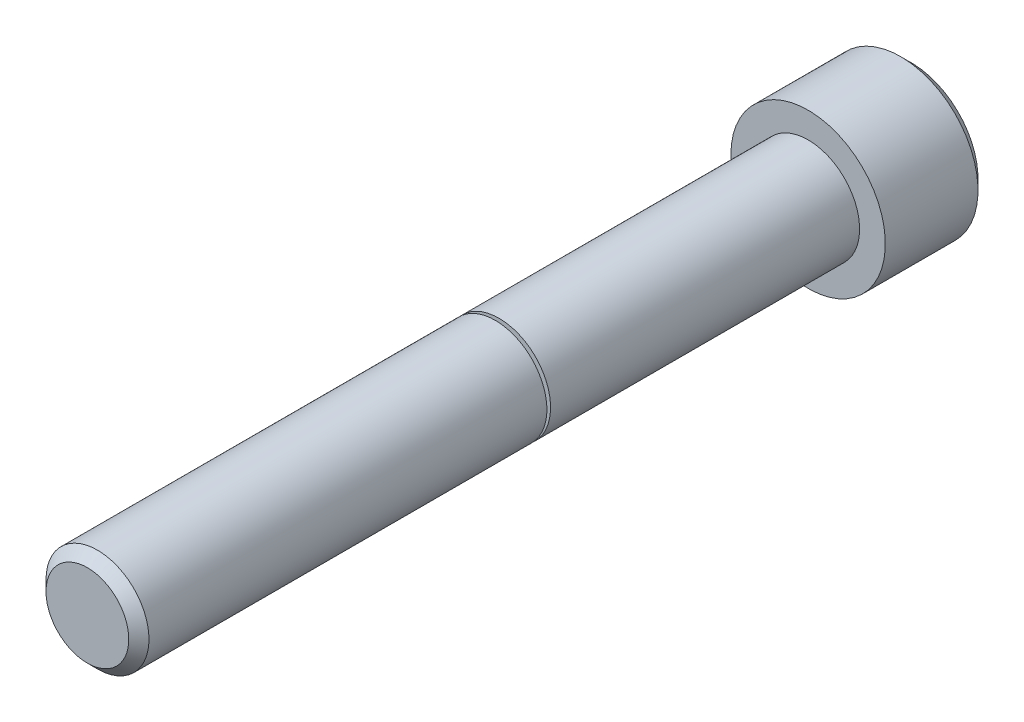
ISO-10303-21;
HEADER;
FILE_DESCRIPTION(('STEP AP214'),'2;1');
FILE_NAME('part.step','',(''),(''),'','','');
FILE_SCHEMA(('AUTOMOTIVE_DESIGN { 1 0 10303 214 1 1 1 1 }'));
ENDSEC;
DATA;
#1=APPLICATION_CONTEXT('core data for automotive mechanical design processes');
#2=APPLICATION_PROTOCOL_DEFINITION('international standard','automotive_design',2000,#1);
#3=PRODUCT_CONTEXT('',#1,'mechanical');
#4=PRODUCT('Part','Part','',(#3));
#5=PRODUCT_RELATED_PRODUCT_CATEGORY('part','',(#4));
#6=PRODUCT_DEFINITION_FORMATION('','',#4);
#7=PRODUCT_DEFINITION_CONTEXT('part definition',#1,'design');
#8=PRODUCT_DEFINITION('design','',#6,#7);
#9=PRODUCT_DEFINITION_SHAPE('','',#8);
#10=(LENGTH_UNIT() NAMED_UNIT(*) SI_UNIT(.MILLI.,.METRE.));
#11=(NAMED_UNIT(*) PLANE_ANGLE_UNIT() SI_UNIT($,.RADIAN.));
#12=(NAMED_UNIT(*) SI_UNIT($,.STERADIAN.) SOLID_ANGLE_UNIT());
#13=UNCERTAINTY_MEASURE_WITH_UNIT(LENGTH_MEASURE(1.E-05),#10,'distance_accuracy_value','');
#14=(GEOMETRIC_REPRESENTATION_CONTEXT(3) GLOBAL_UNCERTAINTY_ASSIGNED_CONTEXT((#13)) GLOBAL_UNIT_ASSIGNED_CONTEXT((#10,
#11,#12)) REPRESENTATION_CONTEXT('',''));
#15=CARTESIAN_POINT('',(0.,0.,0.));
#16=DIRECTION('',(0.,0.,1.));
#17=DIRECTION('',(1.,0.,0.));
#18=AXIS2_PLACEMENT_3D('',#15,#16,#17);
#19=CARTESIAN_POINT('',(0.,0.,-6.34999999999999));
#20=DIRECTION('',(0.,0.,1.));
#21=DIRECTION('',(1.,0.,0.));
#22=AXIS2_PLACEMENT_3D('',#19,#20,#21);
#23=PLANE('',#22);
#24=DIRECTION('',(-0.5,-0.866025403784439,0.));
#25=VECTOR('',#24,1.);
#26=CARTESIAN_POINT('',(2.74963065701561,0.,-6.34999999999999));
#27=LINE('',#26,#25);
#28=CARTESIAN_POINT('',(2.74963065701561,0.,-6.34999999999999));
#29=VERTEX_POINT('',#28);
#30=CARTESIAN_POINT('',(1.37481532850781,-2.38125,-6.34999999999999));
#31=VERTEX_POINT('',#30);
#32=EDGE_CURVE('E145',#29,#31,#27,.T.);
#33=ORIENTED_EDGE('',*,*,#32,.F.);
#34=DIRECTION('',(0.499999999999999,-0.866025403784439,0.));
#35=VECTOR('',#34,1.);
#36=CARTESIAN_POINT('',(1.37481532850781,2.38125,-6.34999999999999));
#37=LINE('',#36,#35);
#38=CARTESIAN_POINT('',(1.37481532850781,2.38125,-6.34999999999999));
#39=VERTEX_POINT('',#38);
#40=EDGE_CURVE('E64',#39,#29,#37,.T.);
#41=ORIENTED_EDGE('',*,*,#40,.F.);
#42=DIRECTION('',(1.,0.,0.));
#43=VECTOR('',#42,1.);
#44=CARTESIAN_POINT('',(-1.37481532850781,2.38125,-6.34999999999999));
#45=LINE('',#44,#43);
#46=CARTESIAN_POINT('',(-1.37481532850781,2.38125,-6.34999999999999));
#47=VERTEX_POINT('',#46);
#48=EDGE_CURVE('E158',#47,#39,#45,.T.);
#49=ORIENTED_EDGE('',*,*,#48,.F.);
#50=DIRECTION('',(0.5,0.866025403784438,0.));
#51=VECTOR('',#50,1.);
#52=CARTESIAN_POINT('',(-2.74963065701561,0.,-6.34999999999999));
#53=LINE('',#52,#51);
#54=CARTESIAN_POINT('',(-2.74963065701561,0.,-6.34999999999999));
#55=VERTEX_POINT('',#54);
#56=EDGE_CURVE('E155',#55,#47,#53,.T.);
#57=ORIENTED_EDGE('',*,*,#56,.F.);
#58=DIRECTION('',(-0.5,0.866025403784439,0.));
#59=VECTOR('',#58,1.);
#60=CARTESIAN_POINT('',(-1.37481532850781,-2.38125,-6.34999999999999));
#61=LINE('',#60,#59);
#62=CARTESIAN_POINT('',(-1.37481532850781,-2.38125,-6.34999999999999));
#63=VERTEX_POINT('',#62);
#64=EDGE_CURVE('E112',#63,#55,#61,.T.);
#65=ORIENTED_EDGE('',*,*,#64,.F.);
#66=DIRECTION('',(-1.,0.,0.));
#67=VECTOR('',#66,1.);
#68=CARTESIAN_POINT('',(1.37481532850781,-2.38125,-6.34999999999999));
#69=LINE('',#68,#67);
#70=EDGE_CURVE('E149',#31,#63,#69,.T.);
#71=ORIENTED_EDGE('',*,*,#70,.F.);
#72=EDGE_LOOP('',(#33,#41,#49,#57,#65,#71));
#73=FACE_BOUND('',#72,.T.);
#74=CARTESIAN_POINT('',(0.,0.,-6.34999999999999));
#75=DIRECTION('',(0.,0.,-1.));
#76=DIRECTION('',(-1.,0.,0.));
#77=AXIS2_PLACEMENT_3D('',#74,#75,#76);
#78=CIRCLE('',#77,4.1275);
#79=CARTESIAN_POINT('',(-4.1275,0.,-6.34999999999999));
#80=VERTEX_POINT('',#79);
#81=EDGE_CURVE('E164',#80,#80,#78,.T.);
#82=ORIENTED_EDGE('',*,*,#81,.T.);
#83=EDGE_LOOP('',(#82));
#84=FACE_BOUND('',#83,.T.);
#85=ADVANCED_FACE('F49',(#73,#84),#23,.F.);
#86=CARTESIAN_POINT('',(-2.55270000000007,0.,44.45));
#87=DIRECTION('',(0.,0.,-1.));
#88=DIRECTION('',(-1.,0.,0.));
#89=AXIS2_PLACEMENT_3D('',#86,#87,#88);
#90=PLANE('',#89);
#91=CARTESIAN_POINT('',(0.,0.,44.45));
#92=DIRECTION('',(0.,0.,-1.));
#93=DIRECTION('',(-1.,0.,0.));
#94=AXIS2_PLACEMENT_3D('',#91,#92,#93);
#95=CIRCLE('',#94,2.55270000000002);
#96=CARTESIAN_POINT('',(-2.55270000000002,0.,44.45));
#97=VERTEX_POINT('',#96);
#98=EDGE_CURVE('E11',#97,#97,#95,.T.);
#99=ORIENTED_EDGE('',*,*,#98,.F.);
#100=EDGE_LOOP('',(#99));
#101=FACE_BOUND('',#100,.T.);
#102=ADVANCED_FACE('F214',(#101),#90,.F.);
#103=CARTESIAN_POINT('',(0.,0.,44.45));
#104=DIRECTION('',(0.,0.,-1.));
#105=DIRECTION('',(-1.,0.,0.));
#106=AXIS2_PLACEMENT_3D('',#103,#104,#105);
#107=CONICAL_SURFACE('',#106,2.55270000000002,0.785398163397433);
#108=CARTESIAN_POINT('',(0.,0.,43.8277));
#109=DIRECTION('',(0.,0.,-1.));
#110=DIRECTION('',(-1.,0.,0.));
#111=AXIS2_PLACEMENT_3D('',#108,#109,#110);
#112=CIRCLE('',#111,3.17500000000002);
#113=CARTESIAN_POINT('',(-3.17500000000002,0.,43.8277));
#114=VERTEX_POINT('',#113);
#115=EDGE_CURVE('E57',#114,#114,#112,.T.);
#116=ORIENTED_EDGE('',*,*,#115,.F.);
#117=EDGE_LOOP('',(#116));
#118=FACE_BOUND('',#117,.T.);
#119=ORIENTED_EDGE('',*,*,#98,.T.);
#120=EDGE_LOOP('',(#119));
#121=FACE_BOUND('',#120,.T.);
#122=ADVANCED_FACE('F211',(#118,#121),#107,.T.);
#123=CARTESIAN_POINT('',(0.,0.,-10.585154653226));
#124=DIRECTION('',(0.,0.,-1.));
#125=DIRECTION('',(-1.,0.,0.));
#126=AXIS2_PLACEMENT_3D('',#123,#124,#125);
#127=CYLINDRICAL_SURFACE('',#126,3.17500000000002);
#128=CARTESIAN_POINT('',(0.,0.,19.2864986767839));
#129=DIRECTION('',(0.,0.,-1.));
#130=DIRECTION('',(-1.,0.,0.));
#131=AXIS2_PLACEMENT_3D('',#128,#129,#130);
#132=CIRCLE('',#131,3.17500000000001);
#133=CARTESIAN_POINT('',(-3.17500000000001,0.,19.2864986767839));
#134=VERTEX_POINT('',#133);
#135=EDGE_CURVE('E201',#134,#134,#132,.T.);
#136=ORIENTED_EDGE('',*,*,#135,.F.);
#137=EDGE_LOOP('',(#136));
#138=FACE_BOUND('',#137,.T.);
#139=ORIENTED_EDGE('',*,*,#115,.T.);
#140=EDGE_LOOP('',(#139));
#141=FACE_BOUND('',#140,.T.);
#142=ADVANCED_FACE('F209',(#138,#141),#127,.T.);
#143=CARTESIAN_POINT('',(0.,0.,19.2864986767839));
#144=DIRECTION('',(0.,0.,1.));
#145=DIRECTION('',(1.,0.,0.));
#146=AXIS2_PLACEMENT_3D('',#143,#144,#145);
#147=CONICAL_SURFACE('',#146,3.17500000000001,1.22173047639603);
#148=CARTESIAN_POINT('',(0.,0.,19.0987938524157));
#149=DIRECTION('',(0.,0.,-1.));
#150=DIRECTION('',(-1.,0.,0.));
#151=AXIS2_PLACEMENT_3D('',#148,#149,#150);
#152=CIRCLE('',#151,2.65928523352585);
#153=CARTESIAN_POINT('',(-2.65928523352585,0.,19.0987938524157));
#154=VERTEX_POINT('',#153);
#155=EDGE_CURVE('E197',#154,#154,#152,.T.);
#156=ORIENTED_EDGE('',*,*,#155,.F.);
#157=EDGE_LOOP('',(#156));
#158=FACE_BOUND('',#157,.T.);
#159=ORIENTED_EDGE('',*,*,#135,.T.);
#160=EDGE_LOOP('',(#159));
#161=FACE_BOUND('',#160,.T.);
#162=ADVANCED_FACE('F226',(#158,#161),#147,.T.);
#163=CARTESIAN_POINT('',(0.,0.,19.08));
#164=DIRECTION('',(0.,0.,-1.));
#165=DIRECTION('',(-1.,0.,0.));
#166=AXIS2_PLACEMENT_3D('',#163,#164,#165);
#167=TOROIDAL_SURFACE('',#166,2.66612563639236,0.0199999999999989);
#168=CARTESIAN_POINT('',(0.,0.,19.06));
#169=DIRECTION('',(0.,0.,-1.));
#170=DIRECTION('',(-1.,0.,0.));
#171=AXIS2_PLACEMENT_3D('',#168,#169,#170);
#172=CIRCLE('',#171,2.66612563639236);
#173=CARTESIAN_POINT('',(-2.66612563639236,0.,19.06));
#174=VERTEX_POINT('',#173);
#175=EDGE_CURVE('E193',#174,#174,#172,.T.);
#176=ORIENTED_EDGE('',*,*,#175,.F.);
#177=EDGE_LOOP('',(#176));
#178=FACE_BOUND('',#177,.T.);
#179=ORIENTED_EDGE('',*,*,#155,.T.);
#180=EDGE_LOOP('',(#179));
#181=FACE_BOUND('',#180,.T.);
#182=ADVANCED_FACE('F230',(#178,#181),#167,.F.);
#183=CARTESIAN_POINT('',(-3.17500000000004,0.,19.06));
#184=DIRECTION('',(0.,0.,-1.));
#185=DIRECTION('',(-1.,0.,0.));
#186=AXIS2_PLACEMENT_3D('',#183,#184,#185);
#187=PLANE('',#186);
#188=CARTESIAN_POINT('',(0.,0.,19.06));
#189=DIRECTION('',(0.,0.,-1.));
#190=DIRECTION('',(-1.,0.,0.));
#191=AXIS2_PLACEMENT_3D('',#188,#189,#190);
#192=CIRCLE('',#191,3.17500000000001);
#193=CARTESIAN_POINT('',(-3.17500000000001,0.,19.06));
#194=VERTEX_POINT('',#193);
#195=EDGE_CURVE('E189',#194,#194,#192,.T.);
#196=ORIENTED_EDGE('',*,*,#195,.F.);
#197=EDGE_LOOP('',(#196));
#198=FACE_BOUND('',#197,.T.);
#199=ORIENTED_EDGE('',*,*,#175,.T.);
#200=EDGE_LOOP('',(#199));
#201=FACE_BOUND('',#200,.T.);
#202=ADVANCED_FACE('F234',(#198,#201),#187,.F.);
#203=CARTESIAN_POINT('',(0.,0.,-10.585154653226));
#204=DIRECTION('',(0.,0.,-1.));
#205=DIRECTION('',(-1.,0.,0.));
#206=AXIS2_PLACEMENT_3D('',#203,#204,#205);
#207=CYLINDRICAL_SURFACE('',#206,3.17500000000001);
#208=CARTESIAN_POINT('',(0.,0.,0.));
#209=DIRECTION('',(0.,0.,-1.));
#210=DIRECTION('',(-1.,0.,0.));
#211=AXIS2_PLACEMENT_3D('',#208,#209,#210);
#212=CIRCLE('',#211,3.175);
#213=CARTESIAN_POINT('',(-3.175,0.,0.));
#214=VERTEX_POINT('',#213);
#215=EDGE_CURVE('E185',#214,#214,#212,.T.);
#216=ORIENTED_EDGE('',*,*,#215,.F.);
#217=EDGE_LOOP('',(#216));
#218=FACE_BOUND('',#217,.T.);
#219=ORIENTED_EDGE('',*,*,#195,.T.);
#220=EDGE_LOOP('',(#219));
#221=FACE_BOUND('',#220,.T.);
#222=ADVANCED_FACE('F238',(#218,#221),#207,.T.);
#223=CARTESIAN_POINT('',(-4.7625,0.,0.));
#224=DIRECTION('',(0.,0.,-1.));
#225=DIRECTION('',(-1.,0.,0.));
#226=AXIS2_PLACEMENT_3D('',#223,#224,#225);
#227=PLANE('',#226);
#228=CARTESIAN_POINT('',(0.,0.,0.));
#229=DIRECTION('',(0.,0.,-1.));
#230=DIRECTION('',(-1.,0.,0.));
#231=AXIS2_PLACEMENT_3D('',#228,#229,#230);
#232=CIRCLE('',#231,4.7625);
#233=CARTESIAN_POINT('',(-4.7625,0.,0.));
#234=VERTEX_POINT('',#233);
#235=EDGE_CURVE('E181',#234,#234,#232,.T.);
#236=ORIENTED_EDGE('',*,*,#235,.F.);
#237=EDGE_LOOP('',(#236));
#238=FACE_BOUND('',#237,.T.);
#239=ORIENTED_EDGE('',*,*,#215,.T.);
#240=EDGE_LOOP('',(#239));
#241=FACE_BOUND('',#240,.T.);
#242=ADVANCED_FACE('F242',(#238,#241),#227,.F.);
#243=CARTESIAN_POINT('',(0.,0.,-10.585154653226));
#244=DIRECTION('',(0.,0.,-1.));
#245=DIRECTION('',(-1.,0.,0.));
#246=AXIS2_PLACEMENT_3D('',#243,#244,#245);
#247=CYLINDRICAL_SURFACE('',#246,4.7625);
#248=CARTESIAN_POINT('',(0.,0.,-5.715));
#249=DIRECTION('',(0.,0.,-1.));
#250=DIRECTION('',(-1.,0.,0.));
#251=AXIS2_PLACEMENT_3D('',#248,#249,#250);
#252=CIRCLE('',#251,4.7625);
#253=CARTESIAN_POINT('',(-4.7625,0.,-5.715));
#254=VERTEX_POINT('',#253);
#255=EDGE_CURVE('E177',#254,#254,#252,.T.);
#256=ORIENTED_EDGE('',*,*,#255,.F.);
#257=EDGE_LOOP('',(#256));
#258=FACE_BOUND('',#257,.T.);
#259=ORIENTED_EDGE('',*,*,#235,.T.);
#260=EDGE_LOOP('',(#259));
#261=FACE_BOUND('',#260,.T.);
#262=ADVANCED_FACE('F246',(#258,#261),#247,.T.);
#263=CARTESIAN_POINT('',(0.,0.,-5.715));
#264=DIRECTION('',(0.,0.,1.));
#265=DIRECTION('',(1.,0.,0.));
#266=AXIS2_PLACEMENT_3D('',#263,#264,#265);
#267=CONICAL_SURFACE('',#266,4.7625,0.785398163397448);
#268=ORIENTED_EDGE('',*,*,#81,.F.);
#269=EDGE_LOOP('',(#268));
#270=FACE_BOUND('',#269,.T.);
#271=ORIENTED_EDGE('',*,*,#255,.T.);
#272=EDGE_LOOP('',(#271));
#273=FACE_BOUND('',#272,.T.);
#274=ADVANCED_FACE('F250',(#270,#273),#267,.T.);
#275=CARTESIAN_POINT('',(1.37481532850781,2.38125,-3.175));
#276=DIRECTION('',(0.866025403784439,0.499999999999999,0.));
#277=DIRECTION('',(-0.5,0.866025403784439,0.));
#278=AXIS2_PLACEMENT_3D('',#275,#276,#277);
#279=PLANE('',#278);
#280=ORIENTED_EDGE('',*,*,#40,.T.);
#281=DIRECTION('',(0.,0.,-1.));
#282=VECTOR('',#281,1.);
#283=CARTESIAN_POINT('',(2.74963065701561,0.,-3.175));
#284=LINE('',#283,#282);
#285=CARTESIAN_POINT('',(2.74963065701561,0.,-3.175));
#286=VERTEX_POINT('',#285);
#287=EDGE_CURVE('E94',#286,#29,#284,.T.);
#288=ORIENTED_EDGE('',*,*,#287,.F.);
#289=DIRECTION('',(0.499999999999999,-0.866025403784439,0.));
#290=VECTOR('',#289,1.);
#291=CARTESIAN_POINT('',(1.37481532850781,2.38125,-3.175));
#292=LINE('',#291,#290);
#293=CARTESIAN_POINT('',(1.37481532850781,2.38125,-3.175));
#294=VERTEX_POINT('',#293);
#295=EDGE_CURVE('E161',#294,#286,#292,.T.);
#296=ORIENTED_EDGE('',*,*,#295,.F.);
#297=DIRECTION('',(0.,0.,-1.));
#298=VECTOR('',#297,1.);
#299=CARTESIAN_POINT('',(1.37481532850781,2.38125,-3.175));
#300=LINE('',#299,#298);
#301=EDGE_CURVE('E72',#294,#39,#300,.T.);
#302=ORIENTED_EDGE('',*,*,#301,.T.);
#303=EDGE_LOOP('',(#280,#288,#296,#302));
#304=FACE_BOUND('',#303,.T.);
#305=ADVANCED_FACE('F254',(#304),#279,.F.);
#306=CARTESIAN_POINT('',(-1.37481532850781,2.38125,-3.175));
#307=DIRECTION('',(0.,1.,0.));
#308=DIRECTION('',(-1.,0.,0.));
#309=AXIS2_PLACEMENT_3D('',#306,#307,#308);
#310=PLANE('',#309);
#311=ORIENTED_EDGE('',*,*,#48,.T.);
#312=ORIENTED_EDGE('',*,*,#301,.F.);
#313=DIRECTION('',(1.,0.,0.));
#314=VECTOR('',#313,1.);
#315=CARTESIAN_POINT('',(-1.37481532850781,2.38125,-3.175));
#316=LINE('',#315,#314);
#317=CARTESIAN_POINT('',(-1.37481532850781,2.38125,-3.175));
#318=VERTEX_POINT('',#317);
#319=EDGE_CURVE('E126',#318,#294,#316,.T.);
#320=ORIENTED_EDGE('',*,*,#319,.F.);
#321=DIRECTION('',(0.,0.,-1.));
#322=VECTOR('',#321,1.);
#323=CARTESIAN_POINT('',(-1.37481532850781,2.38125,-3.175));
#324=LINE('',#323,#322);
#325=EDGE_CURVE('E117',#318,#47,#324,.T.);
#326=ORIENTED_EDGE('',*,*,#325,.T.);
#327=EDGE_LOOP('',(#311,#312,#320,#326));
#328=FACE_BOUND('',#327,.T.);
#329=ADVANCED_FACE('F258',(#328),#310,.F.);
#330=CARTESIAN_POINT('',(-2.74963065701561,0.,-3.175));
#331=DIRECTION('',(-0.866025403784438,0.5,0.));
#332=DIRECTION('',(-0.5,-0.866025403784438,0.));
#333=AXIS2_PLACEMENT_3D('',#330,#331,#332);
#334=PLANE('',#333);
#335=ORIENTED_EDGE('',*,*,#56,.T.);
#336=ORIENTED_EDGE('',*,*,#325,.F.);
#337=DIRECTION('',(0.5,0.866025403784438,0.));
#338=VECTOR('',#337,1.);
#339=CARTESIAN_POINT('',(-2.74963065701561,0.,-3.175));
#340=LINE('',#339,#338);
#341=CARTESIAN_POINT('',(-2.74963065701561,0.,-3.175));
#342=VERTEX_POINT('',#341);
#343=EDGE_CURVE('E121',#342,#318,#340,.T.);
#344=ORIENTED_EDGE('',*,*,#343,.F.);
#345=DIRECTION('',(0.,0.,-1.));
#346=VECTOR('',#345,1.);
#347=CARTESIAN_POINT('',(-2.74963065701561,0.,-3.175));
#348=LINE('',#347,#346);
#349=EDGE_CURVE('E105',#342,#55,#348,.T.);
#350=ORIENTED_EDGE('',*,*,#349,.T.);
#351=EDGE_LOOP('',(#335,#336,#344,#350));
#352=FACE_BOUND('',#351,.T.);
#353=ADVANCED_FACE('F122',(#352),#334,.F.);
#354=CARTESIAN_POINT('',(-1.37481532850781,-2.38125,-3.175));
#355=DIRECTION('',(-0.866025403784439,-0.5,0.));
#356=DIRECTION('',(0.5,-0.866025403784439,0.));
#357=AXIS2_PLACEMENT_3D('',#354,#355,#356);
#358=PLANE('',#357);
#359=ORIENTED_EDGE('',*,*,#64,.T.);
#360=ORIENTED_EDGE('',*,*,#349,.F.);
#361=DIRECTION('',(-0.5,0.866025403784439,0.));
#362=VECTOR('',#361,1.);
#363=CARTESIAN_POINT('',(-1.37481532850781,-2.38125,-3.175));
#364=LINE('',#363,#362);
#365=CARTESIAN_POINT('',(-1.37481532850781,-2.38125,-3.175));
#366=VERTEX_POINT('',#365);
#367=EDGE_CURVE('E109',#366,#342,#364,.T.);
#368=ORIENTED_EDGE('',*,*,#367,.F.);
#369=DIRECTION('',(0.,0.,-1.));
#370=VECTOR('',#369,1.);
#371=CARTESIAN_POINT('',(-1.37481532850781,-2.38125,-3.175));
#372=LINE('',#371,#370);
#373=EDGE_CURVE('E118',#366,#63,#372,.T.);
#374=ORIENTED_EDGE('',*,*,#373,.T.);
#375=EDGE_LOOP('',(#359,#360,#368,#374));
#376=FACE_BOUND('',#375,.T.);
#377=ADVANCED_FACE('F107',(#376),#358,.F.);
#378=CARTESIAN_POINT('',(1.37481532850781,-2.38125,-3.175));
#379=DIRECTION('',(0.,-1.,0.));
#380=DIRECTION('',(0.,0.,-1.));
#381=AXIS2_PLACEMENT_3D('',#378,#379,#380);
#382=PLANE('',#381);
#383=ORIENTED_EDGE('',*,*,#70,.T.);
#384=ORIENTED_EDGE('',*,*,#373,.F.);
#385=DIRECTION('',(-1.,0.,0.));
#386=VECTOR('',#385,1.);
#387=CARTESIAN_POINT('',(1.37481532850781,-2.38125,-3.175));
#388=LINE('',#387,#386);
#389=CARTESIAN_POINT('',(1.37481532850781,-2.38125,-3.175));
#390=VERTEX_POINT('',#389);
#391=EDGE_CURVE('E132',#390,#366,#388,.T.);
#392=ORIENTED_EDGE('',*,*,#391,.F.);
#393=DIRECTION('',(0.,0.,-1.));
#394=VECTOR('',#393,1.);
#395=CARTESIAN_POINT('',(1.37481532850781,-2.38125,-3.175));
#396=LINE('',#395,#394);
#397=EDGE_CURVE('E169',#390,#31,#396,.T.);
#398=ORIENTED_EDGE('',*,*,#397,.T.);
#399=EDGE_LOOP('',(#383,#384,#392,#398));
#400=FACE_BOUND('',#399,.T.);
#401=ADVANCED_FACE('F262',(#400),#382,.F.);
#402=CARTESIAN_POINT('',(2.74963065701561,0.,-3.175));
#403=DIRECTION('',(0.866025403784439,-0.5,0.));
#404=DIRECTION('',(0.5,0.866025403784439,0.));
#405=AXIS2_PLACEMENT_3D('',#402,#403,#404);
#406=PLANE('',#405);
#407=ORIENTED_EDGE('',*,*,#32,.T.);
#408=ORIENTED_EDGE('',*,*,#397,.F.);
#409=DIRECTION('',(-0.5,-0.866025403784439,0.));
#410=VECTOR('',#409,1.);
#411=CARTESIAN_POINT('',(2.74963065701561,0.,-3.175));
#412=LINE('',#411,#410);
#413=EDGE_CURVE('E137',#286,#390,#412,.T.);
#414=ORIENTED_EDGE('',*,*,#413,.F.);
#415=ORIENTED_EDGE('',*,*,#287,.T.);
#416=EDGE_LOOP('',(#407,#408,#414,#415));
#417=FACE_BOUND('',#416,.T.);
#418=ADVANCED_FACE('F259',(#417),#406,.F.);
#419=CARTESIAN_POINT('',(1.37481532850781,2.38125,-3.175));
#420=DIRECTION('',(0.,0.,1.));
#421=DIRECTION('',(1.,0.,0.));
#422=AXIS2_PLACEMENT_3D('',#419,#420,#421);
#423=PLANE('',#422);
#424=ORIENTED_EDGE('',*,*,#295,.T.);
#425=ORIENTED_EDGE('',*,*,#413,.T.);
#426=ORIENTED_EDGE('',*,*,#391,.T.);
#427=ORIENTED_EDGE('',*,*,#367,.T.);
#428=ORIENTED_EDGE('',*,*,#343,.T.);
#429=ORIENTED_EDGE('',*,*,#319,.T.);
#430=EDGE_LOOP('',(#424,#425,#426,#427,#428,#429));
#431=FACE_BOUND('',#430,.T.);
#432=ADVANCED_FACE('F129',(#431),#423,.F.);
#433=CLOSED_SHELL('',(#85,#102,#122,#142,#162,#182,#202,#222,#242,#262,#274,#305,#329,#353,#377,
#401,#418,#432));
#434=MANIFOLD_SOLID_BREP('B2',#433);
#435=ADVANCED_BREP_SHAPE_REPRESENTATION('',(#18,#434),#14);
#436=SHAPE_DEFINITION_REPRESENTATION(#9,#435);
ENDSEC;
END-ISO-10303-21;
